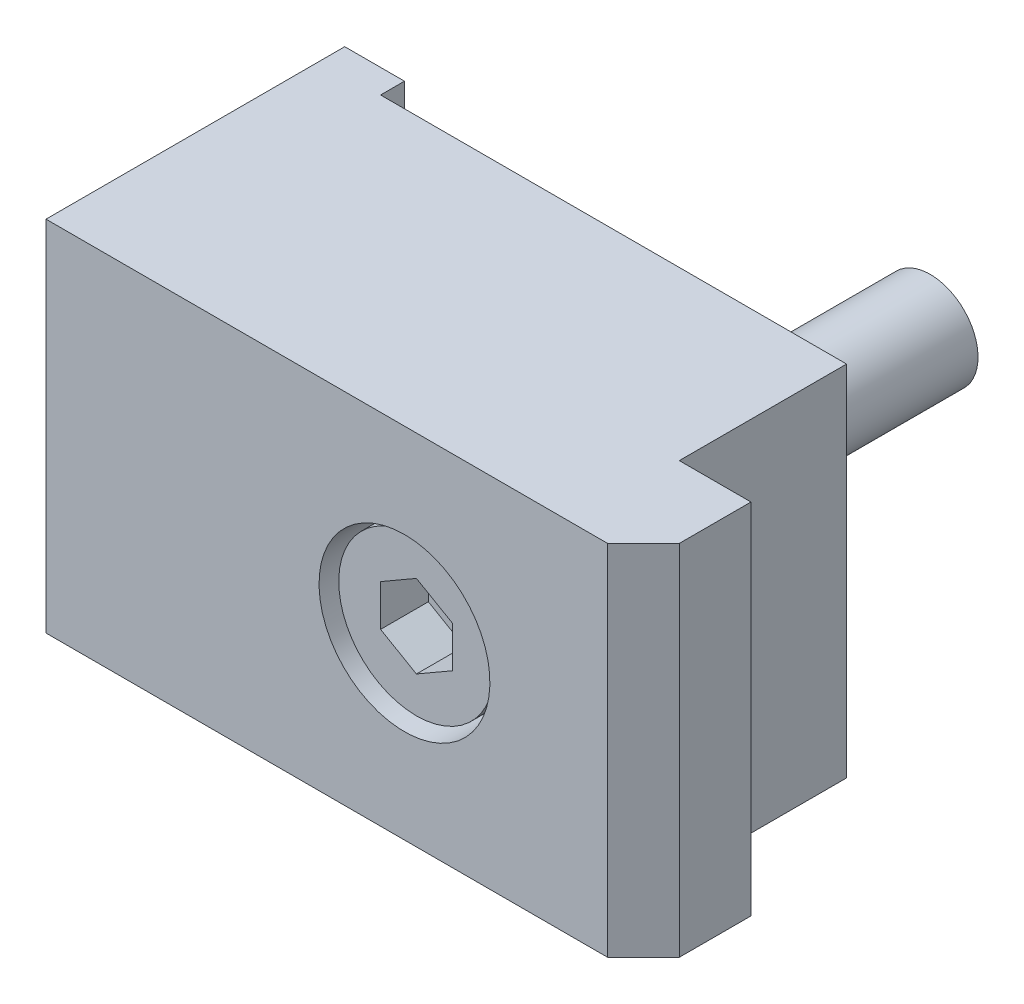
ISO-10303-21;
HEADER;
FILE_DESCRIPTION(('STEP AP214'),'2;1');
FILE_NAME('part.step','',(''),(''),'','','');
FILE_SCHEMA(('AUTOMOTIVE_DESIGN { 1 0 10303 214 1 1 1 1 }'));
ENDSEC;
DATA;
#1=APPLICATION_CONTEXT('core data for automotive mechanical design processes');
#2=APPLICATION_PROTOCOL_DEFINITION('international standard','automotive_design',2000,#1);
#3=PRODUCT_CONTEXT('',#1,'mechanical');
#4=PRODUCT('Part','Part','',(#3));
#5=PRODUCT_RELATED_PRODUCT_CATEGORY('part','',(#4));
#6=PRODUCT_DEFINITION_FORMATION('','',#4);
#7=PRODUCT_DEFINITION_CONTEXT('part definition',#1,'design');
#8=PRODUCT_DEFINITION('design','',#6,#7);
#9=PRODUCT_DEFINITION_SHAPE('','',#8);
#10=(LENGTH_UNIT() NAMED_UNIT(*) SI_UNIT(.MILLI.,.METRE.));
#11=(NAMED_UNIT(*) PLANE_ANGLE_UNIT() SI_UNIT($,.RADIAN.));
#12=(NAMED_UNIT(*) SI_UNIT($,.STERADIAN.) SOLID_ANGLE_UNIT());
#13=UNCERTAINTY_MEASURE_WITH_UNIT(LENGTH_MEASURE(1.E-05),#10,'distance_accuracy_value','');
#14=(GEOMETRIC_REPRESENTATION_CONTEXT(3) GLOBAL_UNCERTAINTY_ASSIGNED_CONTEXT((#13)) GLOBAL_UNIT_ASSIGNED_CONTEXT((#10,
#11,#12)) REPRESENTATION_CONTEXT('',''));
#15=CARTESIAN_POINT('',(0.,0.,0.));
#16=DIRECTION('',(0.,0.,1.));
#17=DIRECTION('',(1.,0.,0.));
#18=AXIS2_PLACEMENT_3D('',#15,#16,#17);
#19=CARTESIAN_POINT('',(-3.,-1.73205080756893,20.));
#20=DIRECTION('',(0.,0.,-1.));
#21=DIRECTION('',(0.,1.,0.));
#22=AXIS2_PLACEMENT_3D('',#19,#20,#21);
#23=PLANE('',#22);
#24=DIRECTION('',(0.866025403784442,-0.5,0.));
#25=VECTOR('',#24,1.);
#26=CARTESIAN_POINT('',(-3.,-1.73205080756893,20.));
#27=LINE('',#26,#25);
#28=CARTESIAN_POINT('',(-3.,-1.73205080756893,20.));
#29=VERTEX_POINT('',#28);
#30=CARTESIAN_POINT('',(0.,-3.46410161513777,20.));
#31=VERTEX_POINT('',#30);
#32=EDGE_CURVE('E260',#29,#31,#27,.T.);
#33=ORIENTED_EDGE('',*,*,#32,.T.);
#34=DIRECTION('',(0.866025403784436,0.5,0.));
#35=VECTOR('',#34,1.);
#36=CARTESIAN_POINT('',(0.,-3.46410161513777,20.));
#37=LINE('',#36,#35);
#38=CARTESIAN_POINT('',(3.,-1.73205080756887,20.));
#39=VERTEX_POINT('',#38);
#40=EDGE_CURVE('E262',#31,#39,#37,.T.);
#41=ORIENTED_EDGE('',*,*,#40,.T.);
#42=DIRECTION('',(0.,1.,0.));
#43=VECTOR('',#42,1.);
#44=CARTESIAN_POINT('',(3.,-1.73205080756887,20.));
#45=LINE('',#44,#43);
#46=CARTESIAN_POINT('',(3.,1.73205080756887,20.));
#47=VERTEX_POINT('',#46);
#48=EDGE_CURVE('E265',#39,#47,#45,.T.);
#49=ORIENTED_EDGE('',*,*,#48,.T.);
#50=DIRECTION('',(-0.866025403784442,0.5,0.));
#51=VECTOR('',#50,1.);
#52=CARTESIAN_POINT('',(3.,1.73205080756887,20.));
#53=LINE('',#52,#51);
#54=CARTESIAN_POINT('',(0.,3.46410161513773,20.));
#55=VERTEX_POINT('',#54);
#56=EDGE_CURVE('E154',#47,#55,#53,.T.);
#57=ORIENTED_EDGE('',*,*,#56,.T.);
#58=DIRECTION('',(-0.866025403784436,-0.5,0.));
#59=VECTOR('',#58,1.);
#60=CARTESIAN_POINT('',(0.,3.46410161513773,20.));
#61=LINE('',#60,#59);
#62=CARTESIAN_POINT('',(-3.,1.73205080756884,20.));
#63=VERTEX_POINT('',#62);
#64=EDGE_CURVE('E137',#55,#63,#61,.T.);
#65=ORIENTED_EDGE('',*,*,#64,.T.);
#66=DIRECTION('',(0.,-1.,0.));
#67=VECTOR('',#66,1.);
#68=CARTESIAN_POINT('',(-3.,1.73205080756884,20.));
#69=LINE('',#68,#67);
#70=EDGE_CURVE('E151',#63,#29,#69,.T.);
#71=ORIENTED_EDGE('',*,*,#70,.T.);
#72=EDGE_LOOP('',(#33,#41,#49,#57,#65,#71));
#73=FACE_BOUND('',#72,.T.);
#74=ADVANCED_FACE('F14',(#73),#23,.F.);
#75=CARTESIAN_POINT('',(0.,-3.46410161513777,20.));
#76=DIRECTION('',(0.5,-0.866025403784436,0.));
#77=DIRECTION('',(0.866025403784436,0.5,0.));
#78=AXIS2_PLACEMENT_3D('',#75,#76,#77);
#79=PLANE('',#78);
#80=DIRECTION('',(0.866025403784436,0.5,0.));
#81=VECTOR('',#80,1.);
#82=CARTESIAN_POINT('',(0.,-3.46410161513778,24.));
#83=LINE('',#82,#81);
#84=CARTESIAN_POINT('',(0.,-3.46410161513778,24.));
#85=VERTEX_POINT('',#84);
#86=CARTESIAN_POINT('',(3.,-1.73205080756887,24.));
#87=VERTEX_POINT('',#86);
#88=EDGE_CURVE('E248',#85,#87,#83,.T.);
#89=ORIENTED_EDGE('',*,*,#88,.T.);
#90=DIRECTION('',(0.,0.,1.));
#91=VECTOR('',#90,1.);
#92=CARTESIAN_POINT('',(3.,-1.73205080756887,20.));
#93=LINE('',#92,#91);
#94=EDGE_CURVE('E108',#39,#87,#93,.T.);
#95=ORIENTED_EDGE('',*,*,#94,.F.);
#96=ORIENTED_EDGE('',*,*,#40,.F.);
#97=DIRECTION('',(0.,0.,1.));
#98=VECTOR('',#97,1.);
#99=CARTESIAN_POINT('',(0.,-3.46410161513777,20.));
#100=LINE('',#99,#98);
#101=EDGE_CURVE('E158',#31,#85,#100,.T.);
#102=ORIENTED_EDGE('',*,*,#101,.T.);
#103=EDGE_LOOP('',(#89,#95,#96,#102));
#104=FACE_BOUND('',#103,.T.);
#105=ADVANCED_FACE('F277',(#104),#79,.F.);
#106=CARTESIAN_POINT('',(3.,-1.73205080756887,20.));
#107=DIRECTION('',(1.,0.,0.));
#108=DIRECTION('',(0.,1.,0.));
#109=AXIS2_PLACEMENT_3D('',#106,#107,#108);
#110=PLANE('',#109);
#111=DIRECTION('',(0.,1.,0.));
#112=VECTOR('',#111,1.);
#113=CARTESIAN_POINT('',(3.,-1.73205080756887,24.));
#114=LINE('',#113,#112);
#115=CARTESIAN_POINT('',(3.,1.73205080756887,24.));
#116=VERTEX_POINT('',#115);
#117=EDGE_CURVE('E250',#87,#116,#114,.T.);
#118=ORIENTED_EDGE('',*,*,#117,.T.);
#119=DIRECTION('',(0.,0.,1.));
#120=VECTOR('',#119,1.);
#121=CARTESIAN_POINT('',(3.,1.73205080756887,20.));
#122=LINE('',#121,#120);
#123=EDGE_CURVE('E166',#47,#116,#122,.T.);
#124=ORIENTED_EDGE('',*,*,#123,.F.);
#125=ORIENTED_EDGE('',*,*,#48,.F.);
#126=ORIENTED_EDGE('',*,*,#94,.T.);
#127=EDGE_LOOP('',(#118,#124,#125,#126));
#128=FACE_BOUND('',#127,.T.);
#129=ADVANCED_FACE('F267',(#128),#110,.F.);
#130=CARTESIAN_POINT('',(3.,1.73205080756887,20.));
#131=DIRECTION('',(0.5,0.866025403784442,0.));
#132=DIRECTION('',(-0.866025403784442,0.5,0.));
#133=AXIS2_PLACEMENT_3D('',#130,#131,#132);
#134=PLANE('',#133);
#135=DIRECTION('',(-0.866025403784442,0.5,0.));
#136=VECTOR('',#135,1.);
#137=CARTESIAN_POINT('',(3.,1.73205080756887,24.));
#138=LINE('',#137,#136);
#139=CARTESIAN_POINT('',(0.,3.46410161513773,24.));
#140=VERTEX_POINT('',#139);
#141=EDGE_CURVE('E254',#116,#140,#138,.T.);
#142=ORIENTED_EDGE('',*,*,#141,.T.);
#143=DIRECTION('',(0.,0.,1.));
#144=VECTOR('',#143,1.);
#145=CARTESIAN_POINT('',(0.,3.46410161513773,20.));
#146=LINE('',#145,#144);
#147=EDGE_CURVE('E146',#55,#140,#146,.T.);
#148=ORIENTED_EDGE('',*,*,#147,.F.);
#149=ORIENTED_EDGE('',*,*,#56,.F.);
#150=ORIENTED_EDGE('',*,*,#123,.T.);
#151=EDGE_LOOP('',(#142,#148,#149,#150));
#152=FACE_BOUND('',#151,.T.);
#153=ADVANCED_FACE('F271',(#152),#134,.F.);
#154=CARTESIAN_POINT('',(0.,3.46410161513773,20.));
#155=DIRECTION('',(-0.5,0.866025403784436,0.));
#156=DIRECTION('',(-0.866025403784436,-0.5,0.));
#157=AXIS2_PLACEMENT_3D('',#154,#155,#156);
#158=PLANE('',#157);
#159=DIRECTION('',(-0.866025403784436,-0.5,0.));
#160=VECTOR('',#159,1.);
#161=CARTESIAN_POINT('',(0.,3.46410161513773,24.));
#162=LINE('',#161,#160);
#163=CARTESIAN_POINT('',(-3.,1.73205080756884,24.));
#164=VERTEX_POINT('',#163);
#165=EDGE_CURVE('E140',#140,#164,#162,.T.);
#166=ORIENTED_EDGE('',*,*,#165,.T.);
#167=DIRECTION('',(0.,0.,1.));
#168=VECTOR('',#167,1.);
#169=CARTESIAN_POINT('',(-3.,1.73205080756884,20.));
#170=LINE('',#169,#168);
#171=EDGE_CURVE('E134',#63,#164,#170,.T.);
#172=ORIENTED_EDGE('',*,*,#171,.F.);
#173=ORIENTED_EDGE('',*,*,#64,.F.);
#174=ORIENTED_EDGE('',*,*,#147,.T.);
#175=EDGE_LOOP('',(#166,#172,#173,#174));
#176=FACE_BOUND('',#175,.T.);
#177=ADVANCED_FACE('F136',(#176),#158,.F.);
#178=CARTESIAN_POINT('',(-3.,1.73205080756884,20.));
#179=DIRECTION('',(-1.,0.,0.));
#180=DIRECTION('',(0.,-1.,0.));
#181=AXIS2_PLACEMENT_3D('',#178,#179,#180);
#182=PLANE('',#181);
#183=DIRECTION('',(0.,-1.,0.));
#184=VECTOR('',#183,1.);
#185=CARTESIAN_POINT('',(-3.,1.73205080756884,24.));
#186=LINE('',#185,#184);
#187=CARTESIAN_POINT('',(-3.,-1.73205080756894,24.));
#188=VERTEX_POINT('',#187);
#189=EDGE_CURVE('E258',#164,#188,#186,.T.);
#190=ORIENTED_EDGE('',*,*,#189,.T.);
#191=DIRECTION('',(0.,0.,1.));
#192=VECTOR('',#191,1.);
#193=CARTESIAN_POINT('',(-3.,-1.73205080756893,20.));
#194=LINE('',#193,#192);
#195=EDGE_CURVE('E145',#29,#188,#194,.T.);
#196=ORIENTED_EDGE('',*,*,#195,.F.);
#197=ORIENTED_EDGE('',*,*,#70,.F.);
#198=ORIENTED_EDGE('',*,*,#171,.T.);
#199=EDGE_LOOP('',(#190,#196,#197,#198));
#200=FACE_BOUND('',#199,.T.);
#201=ADVANCED_FACE('F156',(#200),#182,.F.);
#202=CARTESIAN_POINT('',(-3.,-1.73205080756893,20.));
#203=DIRECTION('',(-0.5,-0.866025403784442,0.));
#204=DIRECTION('',(0.866025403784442,-0.5,0.));
#205=AXIS2_PLACEMENT_3D('',#202,#203,#204);
#206=PLANE('',#205);
#207=DIRECTION('',(0.866025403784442,-0.5,0.));
#208=VECTOR('',#207,1.);
#209=CARTESIAN_POINT('',(-3.,-1.73205080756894,24.));
#210=LINE('',#209,#208);
#211=EDGE_CURVE('E33',#188,#85,#210,.T.);
#212=ORIENTED_EDGE('',*,*,#211,.T.);
#213=ORIENTED_EDGE('',*,*,#101,.F.);
#214=ORIENTED_EDGE('',*,*,#32,.F.);
#215=ORIENTED_EDGE('',*,*,#195,.T.);
#216=EDGE_LOOP('',(#212,#213,#214,#215));
#217=FACE_BOUND('',#216,.T.);
#218=ADVANCED_FACE('F278',(#217),#206,.F.);
#219=CARTESIAN_POINT('',(0.,0.,24.));
#220=DIRECTION('',(0.,0.,1.));
#221=DIRECTION('',(0.,-1.,0.));
#222=AXIS2_PLACEMENT_3D('',#219,#220,#221);
#223=PLANE('',#222);
#224=ORIENTED_EDGE('',*,*,#211,.F.);
#225=ORIENTED_EDGE('',*,*,#189,.F.);
#226=ORIENTED_EDGE('',*,*,#165,.F.);
#227=ORIENTED_EDGE('',*,*,#141,.F.);
#228=ORIENTED_EDGE('',*,*,#117,.F.);
#229=ORIENTED_EDGE('',*,*,#88,.F.);
#230=EDGE_LOOP('',(#224,#225,#226,#227,#228,#229));
#231=FACE_BOUND('',#230,.T.);
#232=CARTESIAN_POINT('',(0.,0.,24.));
#233=DIRECTION('',(0.,0.,1.));
#234=DIRECTION('',(0.,-1.,0.));
#235=AXIS2_PLACEMENT_3D('',#232,#233,#234);
#236=CIRCLE('',#235,6.5);
#237=CARTESIAN_POINT('',(0.,-6.50000000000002,24.));
#238=VERTEX_POINT('',#237);
#239=EDGE_CURVE('E171',#238,#238,#236,.T.);
#240=ORIENTED_EDGE('',*,*,#239,.T.);
#241=EDGE_LOOP('',(#240));
#242=FACE_BOUND('',#241,.T.);
#243=ADVANCED_FACE('F273',(#231,#242),#223,.T.);
#244=CARTESIAN_POINT('',(0.,0.,24.));
#245=DIRECTION('',(0.,0.,-1.));
#246=DIRECTION('',(0.,1.,0.));
#247=AXIS2_PLACEMENT_3D('',#244,#245,#246);
#248=CYLINDRICAL_SURFACE('',#247,6.5);
#249=ORIENTED_EDGE('',*,*,#239,.F.);
#250=EDGE_LOOP('',(#249));
#251=FACE_BOUND('',#250,.T.);
#252=CARTESIAN_POINT('',(0.,0.,16.));
#253=DIRECTION('',(0.,0.,1.));
#254=DIRECTION('',(0.,-1.,0.));
#255=AXIS2_PLACEMENT_3D('',#252,#253,#254);
#256=CIRCLE('',#255,6.5);
#257=CARTESIAN_POINT('',(0.,-6.50000000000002,16.));
#258=VERTEX_POINT('',#257);
#259=EDGE_CURVE('E163',#258,#258,#256,.T.);
#260=ORIENTED_EDGE('',*,*,#259,.T.);
#261=EDGE_LOOP('',(#260));
#262=FACE_BOUND('',#261,.T.);
#263=ADVANCED_FACE('F287',(#251,#262),#248,.T.);
#264=CARTESIAN_POINT('',(0.,0.,16.));
#265=DIRECTION('',(0.,0.,1.));
#266=DIRECTION('',(0.,-1.,0.));
#267=AXIS2_PLACEMENT_3D('',#264,#265,#266);
#268=PLANE('',#267);
#269=CARTESIAN_POINT('',(0.,0.,16.));
#270=DIRECTION('',(0.,0.,1.));
#271=DIRECTION('',(0.,-1.,0.));
#272=AXIS2_PLACEMENT_3D('',#269,#270,#271);
#273=CIRCLE('',#272,4.);
#274=CARTESIAN_POINT('',(0.,-4.00000000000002,16.));
#275=VERTEX_POINT('',#274);
#276=EDGE_CURVE('E24',#275,#275,#273,.T.);
#277=ORIENTED_EDGE('',*,*,#276,.T.);
#278=EDGE_LOOP('',(#277));
#279=FACE_BOUND('',#278,.T.);
#280=CARTESIAN_POINT('',(0.,0.,16.));
#281=DIRECTION('',(0.,0.,1.));
#282=DIRECTION('',(0.,1.,0.));
#283=AXIS2_PLACEMENT_3D('',#280,#281,#282);
#284=CIRCLE('',#283,4.5);
#285=CARTESIAN_POINT('',(0.,4.5,16.));
#286=VERTEX_POINT('',#285);
#287=EDGE_CURVE('E9',#286,#286,#284,.T.);
#288=ORIENTED_EDGE('',*,*,#287,.F.);
#289=EDGE_LOOP('',(#288));
#290=FACE_BOUND('',#289,.T.);
#291=ADVANCED_FACE('F359',(#279,#290),#268,.F.);
#292=CARTESIAN_POINT('',(0.,0.,16.));
#293=DIRECTION('',(0.,0.,-1.));
#294=DIRECTION('',(0.,1.,0.));
#295=AXIS2_PLACEMENT_3D('',#292,#293,#294);
#296=CYLINDRICAL_SURFACE('',#295,4.);
#297=ORIENTED_EDGE('',*,*,#276,.F.);
#298=EDGE_LOOP('',(#297));
#299=FACE_BOUND('',#298,.T.);
#300=CARTESIAN_POINT('',(0.,0.,-19.));
#301=DIRECTION('',(0.,0.,1.));
#302=DIRECTION('',(0.,-1.,0.));
#303=AXIS2_PLACEMENT_3D('',#300,#301,#302);
#304=CIRCLE('',#303,4.);
#305=CARTESIAN_POINT('',(0.,-4.00000000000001,-19.));
#306=VERTEX_POINT('',#305);
#307=EDGE_CURVE('E174',#306,#306,#304,.T.);
#308=ORIENTED_EDGE('',*,*,#307,.T.);
#309=EDGE_LOOP('',(#308));
#310=FACE_BOUND('',#309,.T.);
#311=ADVANCED_FACE('F367',(#299,#310),#296,.T.);
#312=CARTESIAN_POINT('',(0.,0.,-19.));
#313=DIRECTION('',(0.,0.,1.));
#314=DIRECTION('',(0.,-1.,0.));
#315=AXIS2_PLACEMENT_3D('',#312,#313,#314);
#316=PLANE('',#315);
#317=ORIENTED_EDGE('',*,*,#307,.F.);
#318=EDGE_LOOP('',(#317));
#319=FACE_BOUND('',#318,.T.);
#320=ADVANCED_FACE('F376',(#319),#316,.F.);
#321=CARTESIAN_POINT('',(14.,15.,16.));
#322=DIRECTION('',(0.,0.,1.));
#323=DIRECTION('',(1.,0.,0.));
#324=AXIS2_PLACEMENT_3D('',#321,#322,#323);
#325=PLANE('',#324);
#326=DIRECTION('',(-1.,0.,0.));
#327=VECTOR('',#326,1.);
#328=CARTESIAN_POINT('',(14.,-15.,16.));
#329=LINE('',#328,#327);
#330=CARTESIAN_POINT('',(20.,-15.,16.));
#331=VERTEX_POINT('',#330);
#332=CARTESIAN_POINT('',(14.,-15.,16.));
#333=VERTEX_POINT('',#332);
#334=EDGE_CURVE('E200',#331,#333,#329,.T.);
#335=ORIENTED_EDGE('',*,*,#334,.T.);
#336=DIRECTION('',(0.,-1.,0.));
#337=VECTOR('',#336,1.);
#338=CARTESIAN_POINT('',(14.,15.,16.));
#339=LINE('',#338,#337);
#340=CARTESIAN_POINT('',(14.,15.,16.));
#341=VERTEX_POINT('',#340);
#342=EDGE_CURVE('E219',#341,#333,#339,.T.);
#343=ORIENTED_EDGE('',*,*,#342,.F.);
#344=DIRECTION('',(-1.,0.,0.));
#345=VECTOR('',#344,1.);
#346=CARTESIAN_POINT('',(14.,15.,16.));
#347=LINE('',#346,#345);
#348=CARTESIAN_POINT('',(20.,15.,16.));
#349=VERTEX_POINT('',#348);
#350=EDGE_CURVE('E217',#349,#341,#347,.T.);
#351=ORIENTED_EDGE('',*,*,#350,.F.);
#352=DIRECTION('',(0.,-1.,0.));
#353=VECTOR('',#352,1.);
#354=CARTESIAN_POINT('',(20.,15.,16.));
#355=LINE('',#354,#353);
#356=EDGE_CURVE('E222',#349,#331,#355,.T.);
#357=ORIENTED_EDGE('',*,*,#356,.T.);
#358=EDGE_LOOP('',(#335,#343,#351,#357));
#359=FACE_BOUND('',#358,.T.);
#360=ADVANCED_FACE('F385',(#359),#325,.F.);
#361=CARTESIAN_POINT('',(-25.,15.,0.));
#362=DIRECTION('',(0.,0.,1.));
#363=DIRECTION('',(0.,1.,0.));
#364=AXIS2_PLACEMENT_3D('',#361,#362,#363);
#365=PLANE('',#364);
#366=DIRECTION('',(-1.,0.,0.));
#367=VECTOR('',#366,1.);
#368=CARTESIAN_POINT('',(-25.,-15.,0.));
#369=LINE('',#368,#367);
#370=CARTESIAN_POINT('',(-25.,-15.,0.));
#371=VERTEX_POINT('',#370);
#372=CARTESIAN_POINT('',(-30.,-15.,0.));
#373=VERTEX_POINT('',#372);
#374=EDGE_CURVE('E192',#371,#373,#369,.T.);
#375=ORIENTED_EDGE('',*,*,#374,.T.);
#376=DIRECTION('',(0.,-1.,0.));
#377=VECTOR('',#376,1.);
#378=CARTESIAN_POINT('',(-30.,15.,0.));
#379=LINE('',#378,#377);
#380=CARTESIAN_POINT('',(-30.,15.,0.));
#381=VERTEX_POINT('',#380);
#382=EDGE_CURVE('E228',#381,#373,#379,.T.);
#383=ORIENTED_EDGE('',*,*,#382,.F.);
#384=DIRECTION('',(-1.,0.,0.));
#385=VECTOR('',#384,1.);
#386=CARTESIAN_POINT('',(-25.,15.,0.));
#387=LINE('',#386,#385);
#388=CARTESIAN_POINT('',(-25.,15.,0.));
#389=VERTEX_POINT('',#388);
#390=EDGE_CURVE('E209',#389,#381,#387,.T.);
#391=ORIENTED_EDGE('',*,*,#390,.F.);
#392=DIRECTION('',(0.,-1.,0.));
#393=VECTOR('',#392,1.);
#394=CARTESIAN_POINT('',(-25.,15.,0.));
#395=LINE('',#394,#393);
#396=EDGE_CURVE('E231',#389,#371,#395,.T.);
#397=ORIENTED_EDGE('',*,*,#396,.T.);
#398=EDGE_LOOP('',(#375,#383,#391,#397));
#399=FACE_BOUND('',#398,.T.);
#400=ADVANCED_FACE('F394',(#399),#365,.F.);
#401=CARTESIAN_POINT('',(20.,15.,16.));
#402=DIRECTION('',(-1.,0.,0.));
#403=DIRECTION('',(0.,-1.,0.));
#404=AXIS2_PLACEMENT_3D('',#401,#402,#403);
#405=PLANE('',#404);
#406=DIRECTION('',(0.,0.,-1.));
#407=VECTOR('',#406,1.);
#408=CARTESIAN_POINT('',(20.,15.,16.));
#409=LINE('',#408,#407);
#410=CARTESIAN_POINT('',(20.,15.,22.));
#411=VERTEX_POINT('',#410);
#412=EDGE_CURVE('E215',#411,#349,#409,.T.);
#413=ORIENTED_EDGE('',*,*,#412,.F.);
#414=DIRECTION('',(0.,-1.,0.));
#415=VECTOR('',#414,1.);
#416=CARTESIAN_POINT('',(20.,15.,22.));
#417=LINE('',#416,#415);
#418=CARTESIAN_POINT('',(20.,-15.,22.));
#419=VERTEX_POINT('',#418);
#420=EDGE_CURVE('E240',#411,#419,#417,.T.);
#421=ORIENTED_EDGE('',*,*,#420,.T.);
#422=DIRECTION('',(0.,0.,-1.));
#423=VECTOR('',#422,1.);
#424=CARTESIAN_POINT('',(20.,-15.,16.));
#425=LINE('',#424,#423);
#426=EDGE_CURVE('E198',#419,#331,#425,.T.);
#427=ORIENTED_EDGE('',*,*,#426,.T.);
#428=ORIENTED_EDGE('',*,*,#356,.F.);
#429=EDGE_LOOP('',(#413,#421,#427,#428));
#430=FACE_BOUND('',#429,.T.);
#431=ADVANCED_FACE('F398',(#430),#405,.F.);
#432=CARTESIAN_POINT('',(-30.,15.,25.));
#433=DIRECTION('',(1.,0.,0.));
#434=DIRECTION('',(0.,0.,-1.));
#435=AXIS2_PLACEMENT_3D('',#432,#433,#434);
#436=PLANE('',#435);
#437=DIRECTION('',(0.,0.,1.));
#438=VECTOR('',#437,1.);
#439=CARTESIAN_POINT('',(-30.,-15.,25.));
#440=LINE('',#439,#438);
#441=CARTESIAN_POINT('',(-30.,-15.,25.));
#442=VERTEX_POINT('',#441);
#443=EDGE_CURVE('E194',#373,#442,#440,.T.);
#444=ORIENTED_EDGE('',*,*,#443,.T.);
#445=DIRECTION('',(0.,-1.,0.));
#446=VECTOR('',#445,1.);
#447=CARTESIAN_POINT('',(-30.,15.,25.));
#448=LINE('',#447,#446);
#449=CARTESIAN_POINT('',(-30.,15.,25.));
#450=VERTEX_POINT('',#449);
#451=EDGE_CURVE('E225',#450,#442,#448,.T.);
#452=ORIENTED_EDGE('',*,*,#451,.F.);
#453=DIRECTION('',(0.,0.,1.));
#454=VECTOR('',#453,1.);
#455=CARTESIAN_POINT('',(-30.,15.,25.));
#456=LINE('',#455,#454);
#457=EDGE_CURVE('E211',#381,#450,#456,.T.);
#458=ORIENTED_EDGE('',*,*,#457,.F.);
#459=ORIENTED_EDGE('',*,*,#382,.T.);
#460=EDGE_LOOP('',(#444,#452,#458,#459));
#461=FACE_BOUND('',#460,.T.);
#462=ADVANCED_FACE('F407',(#461),#436,.F.);
#463=CARTESIAN_POINT('',(20.,15.,22.));
#464=DIRECTION('',(-0.707106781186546,0.,-0.707106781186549));
#465=DIRECTION('',(-0.707106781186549,0.,0.707106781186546));
#466=AXIS2_PLACEMENT_3D('',#463,#464,#465);
#467=PLANE('',#466);
#468=DIRECTION('',(-0.707106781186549,0.,0.707106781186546));
#469=VECTOR('',#468,1.);
#470=CARTESIAN_POINT('',(20.,15.,22.));
#471=LINE('',#470,#469);
#472=CARTESIAN_POINT('',(17.,15.,25.));
#473=VERTEX_POINT('',#472);
#474=EDGE_CURVE('E244',#473,#411,#471,.F.);
#475=ORIENTED_EDGE('',*,*,#474,.F.);
#476=DIRECTION('',(0.,1.,0.));
#477=VECTOR('',#476,1.);
#478=CARTESIAN_POINT('',(17.,15.,25.));
#479=LINE('',#478,#477);
#480=CARTESIAN_POINT('',(17.,-15.,25.));
#481=VERTEX_POINT('',#480);
#482=EDGE_CURVE('E99',#481,#473,#479,.T.);
#483=ORIENTED_EDGE('',*,*,#482,.F.);
#484=DIRECTION('',(0.707106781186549,0.,-0.707106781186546));
#485=VECTOR('',#484,1.);
#486=CARTESIAN_POINT('',(15.5,-15.,26.5));
#487=LINE('',#486,#485);
#488=EDGE_CURVE('E92',#419,#481,#487,.F.);
#489=ORIENTED_EDGE('',*,*,#488,.F.);
#490=ORIENTED_EDGE('',*,*,#420,.F.);
#491=EDGE_LOOP('',(#475,#483,#489,#490));
#492=FACE_BOUND('',#491,.T.);
#493=ADVANCED_FACE('F424',(#492),#467,.F.);
#494=CARTESIAN_POINT('',(14.,15.,2.));
#495=DIRECTION('',(-1.,0.,0.));
#496=DIRECTION('',(0.,-1.,0.));
#497=AXIS2_PLACEMENT_3D('',#494,#495,#496);
#498=PLANE('',#497);
#499=DIRECTION('',(0.,0.,-1.));
#500=VECTOR('',#499,1.);
#501=CARTESIAN_POINT('',(14.,-15.,2.));
#502=LINE('',#501,#500);
#503=CARTESIAN_POINT('',(14.,-15.,2.));
#504=VERTEX_POINT('',#503);
#505=EDGE_CURVE('E185',#333,#504,#502,.T.);
#506=ORIENTED_EDGE('',*,*,#505,.T.);
#507=DIRECTION('',(0.,-1.,0.));
#508=VECTOR('',#507,1.);
#509=CARTESIAN_POINT('',(14.,15.,2.));
#510=LINE('',#509,#508);
#511=CARTESIAN_POINT('',(14.,15.,2.));
#512=VERTEX_POINT('',#511);
#513=EDGE_CURVE('E237',#512,#504,#510,.T.);
#514=ORIENTED_EDGE('',*,*,#513,.F.);
#515=DIRECTION('',(0.,0.,-1.));
#516=VECTOR('',#515,1.);
#517=CARTESIAN_POINT('',(14.,15.,2.));
#518=LINE('',#517,#516);
#519=EDGE_CURVE('E202',#341,#512,#518,.T.);
#520=ORIENTED_EDGE('',*,*,#519,.F.);
#521=ORIENTED_EDGE('',*,*,#342,.T.);
#522=EDGE_LOOP('',(#506,#514,#520,#521));
#523=FACE_BOUND('',#522,.T.);
#524=ADVANCED_FACE('F16',(#523),#498,.F.);
#525=CARTESIAN_POINT('',(14.,15.,25.));
#526=DIRECTION('',(0.,-1.,0.));
#527=DIRECTION('',(1.,0.,0.));
#528=AXIS2_PLACEMENT_3D('',#525,#526,#527);
#529=PLANE('',#528);
#530=DIRECTION('',(1.,0.,0.));
#531=VECTOR('',#530,1.);
#532=CARTESIAN_POINT('',(20.,15.,25.));
#533=LINE('',#532,#531);
#534=EDGE_CURVE('E213',#450,#473,#533,.T.);
#535=ORIENTED_EDGE('',*,*,#534,.T.);
#536=ORIENTED_EDGE('',*,*,#474,.T.);
#537=ORIENTED_EDGE('',*,*,#412,.T.);
#538=ORIENTED_EDGE('',*,*,#350,.T.);
#539=ORIENTED_EDGE('',*,*,#519,.T.);
#540=DIRECTION('',(-1.,0.,0.));
#541=VECTOR('',#540,1.);
#542=CARTESIAN_POINT('',(14.,15.,2.));
#543=LINE('',#542,#541);
#544=CARTESIAN_POINT('',(-25.,15.,2.));
#545=VERTEX_POINT('',#544);
#546=EDGE_CURVE('E205',#512,#545,#543,.T.);
#547=ORIENTED_EDGE('',*,*,#546,.T.);
#548=DIRECTION('',(0.,0.,-1.));
#549=VECTOR('',#548,1.);
#550=CARTESIAN_POINT('',(-25.,15.,2.));
#551=LINE('',#550,#549);
#552=EDGE_CURVE('E207',#545,#389,#551,.T.);
#553=ORIENTED_EDGE('',*,*,#552,.T.);
#554=ORIENTED_EDGE('',*,*,#390,.T.);
#555=ORIENTED_EDGE('',*,*,#457,.T.);
#556=EDGE_LOOP('',(#535,#536,#537,#538,#539,#547,#553,#554,#555));
#557=FACE_BOUND('',#556,.T.);
#558=ADVANCED_FACE('F397',(#557),#529,.F.);
#559=CARTESIAN_POINT('',(-25.,15.,2.));
#560=DIRECTION('',(-1.,0.,0.));
#561=DIRECTION('',(0.,-1.,0.));
#562=AXIS2_PLACEMENT_3D('',#559,#560,#561);
#563=PLANE('',#562);
#564=DIRECTION('',(0.,0.,-1.));
#565=VECTOR('',#564,1.);
#566=CARTESIAN_POINT('',(-25.,-15.,2.));
#567=LINE('',#566,#565);
#568=CARTESIAN_POINT('',(-25.,-15.,2.));
#569=VERTEX_POINT('',#568);
#570=EDGE_CURVE('E190',#569,#371,#567,.T.);
#571=ORIENTED_EDGE('',*,*,#570,.T.);
#572=ORIENTED_EDGE('',*,*,#396,.F.);
#573=ORIENTED_EDGE('',*,*,#552,.F.);
#574=DIRECTION('',(0.,-1.,0.));
#575=VECTOR('',#574,1.);
#576=CARTESIAN_POINT('',(-25.,15.,2.));
#577=LINE('',#576,#575);
#578=EDGE_CURVE('E234',#545,#569,#577,.T.);
#579=ORIENTED_EDGE('',*,*,#578,.T.);
#580=EDGE_LOOP('',(#571,#572,#573,#579));
#581=FACE_BOUND('',#580,.T.);
#582=ADVANCED_FACE('F408',(#581),#563,.F.);
#583=CARTESIAN_POINT('',(14.,-15.,25.));
#584=DIRECTION('',(0.,-1.,0.));
#585=DIRECTION('',(1.,0.,0.));
#586=AXIS2_PLACEMENT_3D('',#583,#584,#585);
#587=PLANE('',#586);
#588=ORIENTED_EDGE('',*,*,#426,.F.);
#589=ORIENTED_EDGE('',*,*,#488,.T.);
#590=DIRECTION('',(1.,0.,0.));
#591=VECTOR('',#590,1.);
#592=CARTESIAN_POINT('',(20.,-15.,25.));
#593=LINE('',#592,#591);
#594=EDGE_CURVE('E196',#442,#481,#593,.T.);
#595=ORIENTED_EDGE('',*,*,#594,.F.);
#596=ORIENTED_EDGE('',*,*,#443,.F.);
#597=ORIENTED_EDGE('',*,*,#374,.F.);
#598=ORIENTED_EDGE('',*,*,#570,.F.);
#599=DIRECTION('',(-1.,0.,0.));
#600=VECTOR('',#599,1.);
#601=CARTESIAN_POINT('',(14.,-15.,2.));
#602=LINE('',#601,#600);
#603=EDGE_CURVE('E188',#504,#569,#602,.T.);
#604=ORIENTED_EDGE('',*,*,#603,.F.);
#605=ORIENTED_EDGE('',*,*,#505,.F.);
#606=ORIENTED_EDGE('',*,*,#334,.F.);
#607=EDGE_LOOP('',(#588,#589,#595,#596,#597,#598,#604,#605,#606));
#608=FACE_BOUND('',#607,.T.);
#609=ADVANCED_FACE('F436',(#608),#587,.T.);
#610=CARTESIAN_POINT('',(14.,15.,2.));
#611=DIRECTION('',(0.,0.,1.));
#612=DIRECTION('',(0.,1.,0.));
#613=AXIS2_PLACEMENT_3D('',#610,#611,#612);
#614=PLANE('',#613);
#615=CARTESIAN_POINT('',(0.,0.,2.));
#616=DIRECTION('',(0.,0.,1.));
#617=DIRECTION('',(0.,1.,0.));
#618=AXIS2_PLACEMENT_3D('',#615,#616,#617);
#619=CIRCLE('',#618,4.5);
#620=CARTESIAN_POINT('',(0.,4.5,2.));
#621=VERTEX_POINT('',#620);
#622=EDGE_CURVE('E18',#621,#621,#619,.T.);
#623=ORIENTED_EDGE('',*,*,#622,.T.);
#624=EDGE_LOOP('',(#623));
#625=FACE_BOUND('',#624,.T.);
#626=ORIENTED_EDGE('',*,*,#603,.T.);
#627=ORIENTED_EDGE('',*,*,#578,.F.);
#628=ORIENTED_EDGE('',*,*,#546,.F.);
#629=ORIENTED_EDGE('',*,*,#513,.T.);
#630=EDGE_LOOP('',(#626,#627,#628,#629));
#631=FACE_BOUND('',#630,.T.);
#632=ADVANCED_FACE('F444',(#625,#631),#614,.F.);
#633=CARTESIAN_POINT('',(0.,0.,25.));
#634=DIRECTION('',(0.,0.,1.));
#635=DIRECTION('',(0.,1.,0.));
#636=AXIS2_PLACEMENT_3D('',#633,#634,#635);
#637=CYLINDRICAL_SURFACE('',#636,4.5);
#638=ORIENTED_EDGE('',*,*,#287,.T.);
#639=EDGE_LOOP('',(#638));
#640=FACE_BOUND('',#639,.T.);
#641=ORIENTED_EDGE('',*,*,#622,.F.);
#642=EDGE_LOOP('',(#641));
#643=FACE_BOUND('',#642,.T.);
#644=ADVANCED_FACE('F435',(#640,#643),#637,.F.);
#645=CARTESIAN_POINT('',(20.,15.,25.));
#646=DIRECTION('',(0.,0.,-1.));
#647=DIRECTION('',(0.,-1.,0.));
#648=AXIS2_PLACEMENT_3D('',#645,#646,#647);
#649=PLANE('',#648);
#650=CARTESIAN_POINT('',(0.,0.,25.));
#651=DIRECTION('',(0.,0.,1.));
#652=DIRECTION('',(0.,1.,0.));
#653=AXIS2_PLACEMENT_3D('',#650,#651,#652);
#654=CIRCLE('',#653,7.15);
#655=CARTESIAN_POINT('',(0.,7.15,25.));
#656=VERTEX_POINT('',#655);
#657=EDGE_CURVE('E182',#656,#656,#654,.T.);
#658=ORIENTED_EDGE('',*,*,#657,.F.);
#659=EDGE_LOOP('',(#658));
#660=FACE_BOUND('',#659,.T.);
#661=ORIENTED_EDGE('',*,*,#594,.T.);
#662=ORIENTED_EDGE('',*,*,#482,.T.);
#663=ORIENTED_EDGE('',*,*,#534,.F.);
#664=ORIENTED_EDGE('',*,*,#451,.T.);
#665=EDGE_LOOP('',(#661,#662,#663,#664));
#666=FACE_BOUND('',#665,.T.);
#667=ADVANCED_FACE('F417',(#660,#666),#649,.F.);
#668=CARTESIAN_POINT('',(0.,0.,25.));
#669=DIRECTION('',(0.,0.,1.));
#670=DIRECTION('',(0.,1.,0.));
#671=AXIS2_PLACEMENT_3D('',#668,#669,#670);
#672=CYLINDRICAL_SURFACE('',#671,7.15);
#673=CARTESIAN_POINT('',(0.,0.,16.));
#674=DIRECTION('',(0.,0.,1.));
#675=DIRECTION('',(0.,1.,0.));
#676=AXIS2_PLACEMENT_3D('',#673,#674,#675);
#677=CIRCLE('',#676,7.15);
#678=CARTESIAN_POINT('',(0.,7.15,16.));
#679=VERTEX_POINT('',#678);
#680=EDGE_CURVE('E179',#679,#679,#677,.T.);
#681=ORIENTED_EDGE('',*,*,#680,.F.);
#682=EDGE_LOOP('',(#681));
#683=FACE_BOUND('',#682,.T.);
#684=ORIENTED_EDGE('',*,*,#657,.T.);
#685=EDGE_LOOP('',(#684));
#686=FACE_BOUND('',#685,.T.);
#687=ADVANCED_FACE('F482',(#683,#686),#672,.F.);
#688=CARTESIAN_POINT('',(-4.5,0.,16.));
#689=DIRECTION('',(0.,0.,-1.));
#690=DIRECTION('',(0.,-1.,0.));
#691=AXIS2_PLACEMENT_3D('',#688,#689,#690);
#692=PLANE('',#691);
#693=ORIENTED_EDGE('',*,*,#259,.F.);
#694=EDGE_LOOP('',(#693));
#695=FACE_BOUND('',#694,.T.);
#696=ORIENTED_EDGE('',*,*,#680,.T.);
#697=EDGE_LOOP('',(#696));
#698=FACE_BOUND('',#697,.T.);
#699=ADVANCED_FACE('F369',(#695,#698),#692,.F.);
#700=CLOSED_SHELL('',(#74,#105,#129,#153,#177,#201,#218,#243,#263,#291,#311,#320,#360,#400,#431,
#462,#493,#524,#558,#582,#609,#632,#644,#667,#687,#699));
#701=MANIFOLD_SOLID_BREP('B1',#700);
#702=ADVANCED_BREP_SHAPE_REPRESENTATION('',(#18,#701),#14);
#703=SHAPE_DEFINITION_REPRESENTATION(#9,#702);
ENDSEC;
END-ISO-10303-21;
